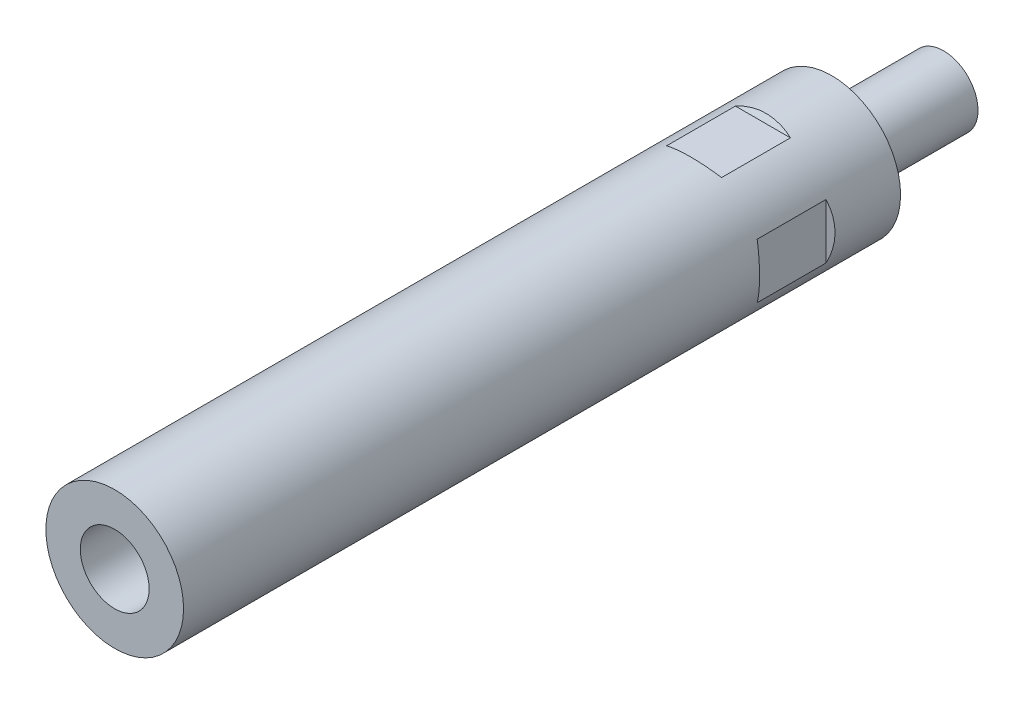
ISO-10303-21;
HEADER;
FILE_DESCRIPTION(('STEP AP214'),'2;1');
FILE_NAME('part.step','',(''),(''),'','','');
FILE_SCHEMA(('AUTOMOTIVE_DESIGN { 1 0 10303 214 1 1 1 1 }'));
ENDSEC;
DATA;
#1=APPLICATION_CONTEXT('core data for automotive mechanical design processes');
#2=APPLICATION_PROTOCOL_DEFINITION('international standard','automotive_design',2000,#1);
#3=PRODUCT_CONTEXT('',#1,'mechanical');
#4=PRODUCT('Part','Part','',(#3));
#5=PRODUCT_RELATED_PRODUCT_CATEGORY('part','',(#4));
#6=PRODUCT_DEFINITION_FORMATION('','',#4);
#7=PRODUCT_DEFINITION_CONTEXT('part definition',#1,'design');
#8=PRODUCT_DEFINITION('design','',#6,#7);
#9=PRODUCT_DEFINITION_SHAPE('','',#8);
#10=(LENGTH_UNIT() NAMED_UNIT(*) SI_UNIT(.MILLI.,.METRE.));
#11=(NAMED_UNIT(*) PLANE_ANGLE_UNIT() SI_UNIT($,.RADIAN.));
#12=(NAMED_UNIT(*) SI_UNIT($,.STERADIAN.) SOLID_ANGLE_UNIT());
#13=UNCERTAINTY_MEASURE_WITH_UNIT(LENGTH_MEASURE(1.E-05),#10,'distance_accuracy_value','');
#14=(GEOMETRIC_REPRESENTATION_CONTEXT(3) GLOBAL_UNCERTAINTY_ASSIGNED_CONTEXT((#13)) GLOBAL_UNIT_ASSIGNED_CONTEXT((#10,
#11,#12)) REPRESENTATION_CONTEXT('',''));
#15=CARTESIAN_POINT('',(0.,0.,0.));
#16=DIRECTION('',(0.,0.,1.));
#17=DIRECTION('',(1.,0.,0.));
#18=AXIS2_PLACEMENT_3D('',#15,#16,#17);
#19=CARTESIAN_POINT('',(0.,0.,0.5));
#20=DIRECTION('',(0.,0.,1.));
#21=DIRECTION('',(0.,-1.,0.));
#22=AXIS2_PLACEMENT_3D('',#19,#20,#21);
#23=CYLINDRICAL_SURFACE('',#22,6.);
#24=CARTESIAN_POINT('',(0.,0.,-19.5));
#25=DIRECTION('',(0.,0.,1.));
#26=DIRECTION('',(0.,-1.,0.));
#27=AXIS2_PLACEMENT_3D('',#24,#25,#26);
#28=CIRCLE('',#27,6.);
#29=CARTESIAN_POINT('',(0.,-6.,-19.5));
#30=VERTEX_POINT('',#29);
#31=EDGE_CURVE('E22',#30,#30,#28,.F.);
#32=ORIENTED_EDGE('',*,*,#31,.F.);
#33=EDGE_LOOP('',(#32));
#34=FACE_BOUND('',#33,.T.);
#35=CARTESIAN_POINT('',(0.,0.,0.));
#36=DIRECTION('',(0.,0.,1.));
#37=DIRECTION('',(1.,0.,0.));
#38=AXIS2_PLACEMENT_3D('',#35,#36,#37);
#39=CIRCLE('',#38,6.);
#40=CARTESIAN_POINT('',(6.,0.,0.));
#41=VERTEX_POINT('',#40);
#42=EDGE_CURVE('E9',#41,#41,#39,.T.);
#43=ORIENTED_EDGE('',*,*,#42,.F.);
#44=EDGE_LOOP('',(#43));
#45=FACE_BOUND('',#44,.T.);
#46=ADVANCED_FACE('F14',(#34,#45),#23,.T.);
#47=CARTESIAN_POINT('',(0.,0.,-19.5));
#48=DIRECTION('',(0.,0.,1.));
#49=DIRECTION('',(0.,-1.,0.));
#50=AXIS2_PLACEMENT_3D('',#47,#48,#49);
#51=PLANE('',#50);
#52=ORIENTED_EDGE('',*,*,#31,.T.);
#53=EDGE_LOOP('',(#52));
#54=FACE_BOUND('',#53,.T.);
#55=ADVANCED_FACE('F16',(#54),#51,.F.);
#56=CARTESIAN_POINT('',(5.1,0.,95.));
#57=DIRECTION('',(0.,0.,-1.));
#58=DIRECTION('',(-1.,0.,0.));
#59=AXIS2_PLACEMENT_3D('',#56,#57,#58);
#60=PLANE('',#59);
#61=CARTESIAN_POINT('',(0.,0.,95.));
#62=DIRECTION('',(0.,0.,1.));
#63=DIRECTION('',(1.,0.,0.));
#64=AXIS2_PLACEMENT_3D('',#61,#62,#63);
#65=CIRCLE('',#64,6.);
#66=CARTESIAN_POINT('',(6.,0.,95.));
#67=VERTEX_POINT('',#66);
#68=EDGE_CURVE('E251',#67,#67,#65,.T.);
#69=ORIENTED_EDGE('',*,*,#68,.T.);
#70=EDGE_LOOP('',(#69));
#71=FACE_BOUND('',#70,.T.);
#72=ADVANCED_FACE('F125',(#71),#60,.F.);
#73=CARTESIAN_POINT('',(0.,0.,125.));
#74=DIRECTION('',(0.,0.,1.));
#75=DIRECTION('',(1.,0.,0.));
#76=AXIS2_PLACEMENT_3D('',#73,#74,#75);
#77=CYLINDRICAL_SURFACE('',#76,6.);
#78=ORIENTED_EDGE('',*,*,#68,.F.);
#79=EDGE_LOOP('',(#78));
#80=FACE_BOUND('',#79,.T.);
#81=CARTESIAN_POINT('',(0.,0.,125.));
#82=DIRECTION('',(0.,0.,1.));
#83=DIRECTION('',(1.,0.,0.));
#84=AXIS2_PLACEMENT_3D('',#81,#82,#83);
#85=CIRCLE('',#84,6.);
#86=CARTESIAN_POINT('',(6.,0.,125.));
#87=VERTEX_POINT('',#86);
#88=EDGE_CURVE('E96',#87,#87,#85,.T.);
#89=ORIENTED_EDGE('',*,*,#88,.T.);
#90=EDGE_LOOP('',(#89));
#91=FACE_BOUND('',#90,.T.);
#92=ADVANCED_FACE('F127',(#80,#91),#77,.F.);
#93=CARTESIAN_POINT('',(0.,0.,125.));
#94=DIRECTION('',(0.,0.,1.));
#95=DIRECTION('',(1.,0.,0.));
#96=AXIS2_PLACEMENT_3D('',#93,#94,#95);
#97=PLANE('',#96);
#98=ORIENTED_EDGE('',*,*,#88,.F.);
#99=EDGE_LOOP('',(#98));
#100=FACE_BOUND('',#99,.T.);
#101=CARTESIAN_POINT('',(0.,0.,125.));
#102=DIRECTION('',(0.,0.,1.));
#103=DIRECTION('',(1.,0.,0.));
#104=AXIS2_PLACEMENT_3D('',#101,#102,#103);
#105=CIRCLE('',#104,12.);
#106=CARTESIAN_POINT('',(12.,0.,125.));
#107=VERTEX_POINT('',#106);
#108=EDGE_CURVE('E239',#107,#107,#105,.T.);
#109=ORIENTED_EDGE('',*,*,#108,.T.);
#110=EDGE_LOOP('',(#109));
#111=FACE_BOUND('',#110,.T.);
#112=ADVANCED_FACE('F134',(#100,#111),#97,.T.);
#113=CARTESIAN_POINT('',(11.,-12.,24.));
#114=DIRECTION('',(-0.5,0.,0.866025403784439));
#115=DIRECTION('',(0.866025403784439,0.,0.5));
#116=AXIS2_PLACEMENT_3D('',#113,#114,#115);
#117=PLANE('',#116);
#118=DIRECTION('',(0.,1.,0.));
#119=VECTOR('',#118,1.);
#120=CARTESIAN_POINT('',(11.,-12.,24.));
#121=LINE('',#120,#119);
#122=CARTESIAN_POINT('',(11.,-4.79583152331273,24.));
#123=VERTEX_POINT('',#122);
#124=CARTESIAN_POINT('',(11.,4.79583152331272,24.));
#125=VERTEX_POINT('',#124);
#126=EDGE_CURVE('E183',#123,#125,#121,.T.);
#127=ORIENTED_EDGE('',*,*,#126,.T.);
#128=CARTESIAN_POINT('',(0.,0.,17.6491470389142));
#129=DIRECTION('',(-0.5,0.,0.866025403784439));
#130=DIRECTION('',(-0.866025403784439,0.,-0.5));
#131=AXIS2_PLACEMENT_3D('',#128,#129,#130);
#132=ELLIPSE('',#131,13.856406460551,12.);
#133=EDGE_CURVE('E35',#123,#125,#132,.T.);
#134=ORIENTED_EDGE('',*,*,#133,.F.);
#135=EDGE_LOOP('',(#127,#134));
#136=FACE_BOUND('',#135,.T.);
#137=ADVANCED_FACE('F175',(#136),#117,.F.);
#138=CARTESIAN_POINT('',(11.,-12.,24.));
#139=DIRECTION('',(-1.,0.,0.));
#140=DIRECTION('',(0.,0.,1.));
#141=AXIS2_PLACEMENT_3D('',#138,#139,#140);
#142=PLANE('',#141);
#143=ORIENTED_EDGE('',*,*,#126,.F.);
#144=DIRECTION('',(0.,0.,-1.));
#145=VECTOR('',#144,1.);
#146=CARTESIAN_POINT('',(11.,-4.79583152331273,125.));
#147=LINE('',#146,#145);
#148=CARTESIAN_POINT('',(11.,-4.79583152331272,12.));
#149=VERTEX_POINT('',#148);
#150=EDGE_CURVE('E191',#149,#123,#147,.F.);
#151=ORIENTED_EDGE('',*,*,#150,.F.);
#152=DIRECTION('',(0.,1.,0.));
#153=VECTOR('',#152,1.);
#154=CARTESIAN_POINT('',(11.,-12.,12.));
#155=LINE('',#154,#153);
#156=CARTESIAN_POINT('',(11.,4.7958315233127,12.));
#157=VERTEX_POINT('',#156);
#158=EDGE_CURVE('E187',#149,#157,#155,.T.);
#159=ORIENTED_EDGE('',*,*,#158,.T.);
#160=DIRECTION('',(0.,0.,-1.));
#161=VECTOR('',#160,1.);
#162=CARTESIAN_POINT('',(11.,4.79583152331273,125.));
#163=LINE('',#162,#161);
#164=EDGE_CURVE('E29',#125,#157,#163,.T.);
#165=ORIENTED_EDGE('',*,*,#164,.F.);
#166=EDGE_LOOP('',(#143,#151,#159,#165));
#167=FACE_BOUND('',#166,.T.);
#168=ADVANCED_FACE('F172',(#167),#142,.F.);
#169=CARTESIAN_POINT('',(11.,-12.,12.));
#170=DIRECTION('',(-0.5,0.,-0.866025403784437));
#171=DIRECTION('',(-0.866025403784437,0.,0.5));
#172=AXIS2_PLACEMENT_3D('',#169,#170,#171);
#173=PLANE('',#172);
#174=CARTESIAN_POINT('',(0.,0.,18.350852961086));
#175=DIRECTION('',(-0.5,0.,-0.866025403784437));
#176=DIRECTION('',(0.866025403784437,0.,-0.5));
#177=AXIS2_PLACEMENT_3D('',#174,#175,#176);
#178=ELLIPSE('',#177,13.856406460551,12.);
#179=EDGE_CURVE('E195',#157,#149,#178,.T.);
#180=ORIENTED_EDGE('',*,*,#179,.F.);
#181=ORIENTED_EDGE('',*,*,#158,.F.);
#182=EDGE_LOOP('',(#180,#181));
#183=FACE_BOUND('',#182,.T.);
#184=ADVANCED_FACE('F167',(#183),#173,.F.);
#185=CARTESIAN_POINT('',(-11.,-12.,12.));
#186=DIRECTION('',(0.5,0.,-0.866025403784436));
#187=DIRECTION('',(-0.866025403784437,0.,-0.5));
#188=AXIS2_PLACEMENT_3D('',#185,#186,#187);
#189=PLANE('',#188);
#190=CARTESIAN_POINT('',(0.,0.,18.350852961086));
#191=DIRECTION('',(0.5,0.,-0.866025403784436));
#192=DIRECTION('',(-0.866025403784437,0.,-0.5));
#193=AXIS2_PLACEMENT_3D('',#190,#191,#192);
#194=ELLIPSE('',#193,13.8564064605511,12.);
#195=CARTESIAN_POINT('',(-11.,-4.79583152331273,12.));
#196=VERTEX_POINT('',#195);
#197=CARTESIAN_POINT('',(-11.,4.79583152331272,12.));
#198=VERTEX_POINT('',#197);
#199=EDGE_CURVE('E193',#196,#198,#194,.T.);
#200=ORIENTED_EDGE('',*,*,#199,.F.);
#201=DIRECTION('',(0.,1.,0.));
#202=VECTOR('',#201,1.);
#203=CARTESIAN_POINT('',(-11.,-12.,12.));
#204=LINE('',#203,#202);
#205=EDGE_CURVE('E227',#196,#198,#204,.T.);
#206=ORIENTED_EDGE('',*,*,#205,.T.);
#207=EDGE_LOOP('',(#200,#206));
#208=FACE_BOUND('',#207,.T.);
#209=ADVANCED_FACE('F163',(#208),#189,.F.);
#210=CARTESIAN_POINT('',(-11.,-12.,24.));
#211=DIRECTION('',(0.5,0.,0.866025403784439));
#212=DIRECTION('',(0.866025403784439,0.,-0.5));
#213=AXIS2_PLACEMENT_3D('',#210,#211,#212);
#214=PLANE('',#213);
#215=DIRECTION('',(0.,1.,0.));
#216=VECTOR('',#215,1.);
#217=CARTESIAN_POINT('',(-11.,-12.,24.));
#218=LINE('',#217,#216);
#219=CARTESIAN_POINT('',(-11.,-4.79583152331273,24.));
#220=VERTEX_POINT('',#219);
#221=CARTESIAN_POINT('',(-11.,4.79583152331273,24.));
#222=VERTEX_POINT('',#221);
#223=EDGE_CURVE('E231',#220,#222,#218,.T.);
#224=ORIENTED_EDGE('',*,*,#223,.F.);
#225=CARTESIAN_POINT('',(0.,0.,17.6491470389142));
#226=DIRECTION('',(0.5,0.,0.866025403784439));
#227=DIRECTION('',(0.866025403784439,0.,-0.5));
#228=AXIS2_PLACEMENT_3D('',#225,#226,#227);
#229=ELLIPSE('',#228,13.856406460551,12.);
#230=EDGE_CURVE('E206',#222,#220,#229,.T.);
#231=ORIENTED_EDGE('',*,*,#230,.F.);
#232=EDGE_LOOP('',(#224,#231));
#233=FACE_BOUND('',#232,.T.);
#234=ADVANCED_FACE('F160',(#233),#214,.F.);
#235=CARTESIAN_POINT('',(-11.,-12.,24.));
#236=DIRECTION('',(1.,0.,0.));
#237=DIRECTION('',(0.,0.,-1.));
#238=AXIS2_PLACEMENT_3D('',#235,#236,#237);
#239=PLANE('',#238);
#240=ORIENTED_EDGE('',*,*,#223,.T.);
#241=DIRECTION('',(0.,0.,-1.));
#242=VECTOR('',#241,1.);
#243=CARTESIAN_POINT('',(-11.,4.79583152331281,125.));
#244=LINE('',#243,#242);
#245=EDGE_CURVE('E200',#198,#222,#244,.F.);
#246=ORIENTED_EDGE('',*,*,#245,.F.);
#247=ORIENTED_EDGE('',*,*,#205,.F.);
#248=DIRECTION('',(0.,0.,-1.));
#249=VECTOR('',#248,1.);
#250=CARTESIAN_POINT('',(-11.,-4.79583152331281,125.));
#251=LINE('',#250,#249);
#252=EDGE_CURVE('E203',#220,#196,#251,.T.);
#253=ORIENTED_EDGE('',*,*,#252,.F.);
#254=EDGE_LOOP('',(#240,#246,#247,#253));
#255=FACE_BOUND('',#254,.T.);
#256=ADVANCED_FACE('F158',(#255),#239,.F.);
#257=CARTESIAN_POINT('',(12.,11.,24.));
#258=DIRECTION('',(0.,-0.5,0.866025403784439));
#259=DIRECTION('',(0.,-0.866025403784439,-0.5));
#260=AXIS2_PLACEMENT_3D('',#257,#258,#259);
#261=PLANE('',#260);
#262=DIRECTION('',(-1.,0.,0.));
#263=VECTOR('',#262,1.);
#264=CARTESIAN_POINT('',(12.,11.,24.));
#265=LINE('',#264,#263);
#266=CARTESIAN_POINT('',(4.79583152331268,11.,24.));
#267=VERTEX_POINT('',#266);
#268=CARTESIAN_POINT('',(-4.79583152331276,11.,24.));
#269=VERTEX_POINT('',#268);
#270=EDGE_CURVE('E225',#267,#269,#265,.T.);
#271=ORIENTED_EDGE('',*,*,#270,.T.);
#272=CARTESIAN_POINT('',(0.,0.,17.6491470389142));
#273=DIRECTION('',(0.,-0.5,0.866025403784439));
#274=DIRECTION('',(0.,-0.866025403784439,-0.5));
#275=AXIS2_PLACEMENT_3D('',#272,#273,#274);
#276=ELLIPSE('',#275,13.856406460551,12.);
#277=EDGE_CURVE('E214',#267,#269,#276,.T.);
#278=ORIENTED_EDGE('',*,*,#277,.F.);
#279=EDGE_LOOP('',(#271,#278));
#280=FACE_BOUND('',#279,.T.);
#281=ADVANCED_FACE('F151',(#280),#261,.F.);
#282=CARTESIAN_POINT('',(12.,11.,24.));
#283=DIRECTION('',(0.,-1.,0.));
#284=DIRECTION('',(1.,0.,0.));
#285=AXIS2_PLACEMENT_3D('',#282,#283,#284);
#286=PLANE('',#285);
#287=ORIENTED_EDGE('',*,*,#270,.F.);
#288=DIRECTION('',(0.,0.,-1.));
#289=VECTOR('',#288,1.);
#290=CARTESIAN_POINT('',(4.79583152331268,11.,125.));
#291=LINE('',#290,#289);
#292=CARTESIAN_POINT('',(4.79583152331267,11.,12.));
#293=VERTEX_POINT('',#292);
#294=EDGE_CURVE('E88',#293,#267,#291,.F.);
#295=ORIENTED_EDGE('',*,*,#294,.F.);
#296=DIRECTION('',(-1.,0.,0.));
#297=VECTOR('',#296,1.);
#298=CARTESIAN_POINT('',(12.,11.,12.));
#299=LINE('',#298,#297);
#300=CARTESIAN_POINT('',(-4.79583152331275,11.,12.));
#301=VERTEX_POINT('',#300);
#302=EDGE_CURVE('E223',#293,#301,#299,.T.);
#303=ORIENTED_EDGE('',*,*,#302,.T.);
#304=DIRECTION('',(0.,0.,-1.));
#305=VECTOR('',#304,1.);
#306=CARTESIAN_POINT('',(-4.79583152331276,11.,125.));
#307=LINE('',#306,#305);
#308=EDGE_CURVE('E211',#269,#301,#307,.T.);
#309=ORIENTED_EDGE('',*,*,#308,.F.);
#310=EDGE_LOOP('',(#287,#295,#303,#309));
#311=FACE_BOUND('',#310,.T.);
#312=ADVANCED_FACE('F148',(#311),#286,.F.);
#313=CARTESIAN_POINT('',(12.,11.,12.));
#314=DIRECTION('',(0.,-0.5,-0.866025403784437));
#315=DIRECTION('',(0.,0.866025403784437,-0.5));
#316=AXIS2_PLACEMENT_3D('',#313,#314,#315);
#317=PLANE('',#316);
#318=CARTESIAN_POINT('',(0.,0.,18.350852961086));
#319=DIRECTION('',(0.,-0.5,-0.866025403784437));
#320=DIRECTION('',(0.,0.866025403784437,-0.5));
#321=AXIS2_PLACEMENT_3D('',#318,#319,#320);
#322=ELLIPSE('',#321,13.856406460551,12.);
#323=EDGE_CURVE('E209',#301,#293,#322,.T.);
#324=ORIENTED_EDGE('',*,*,#323,.F.);
#325=ORIENTED_EDGE('',*,*,#302,.F.);
#326=EDGE_LOOP('',(#324,#325));
#327=FACE_BOUND('',#326,.T.);
#328=ADVANCED_FACE('F145',(#327),#317,.F.);
#329=CARTESIAN_POINT('',(12.,-11.,12.));
#330=DIRECTION('',(0.,0.5,-0.866025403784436));
#331=DIRECTION('',(0.,0.866025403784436,0.5));
#332=AXIS2_PLACEMENT_3D('',#329,#330,#331);
#333=PLANE('',#332);
#334=CARTESIAN_POINT('',(0.,0.,18.350852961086));
#335=DIRECTION('',(0.,0.5,-0.866025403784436));
#336=DIRECTION('',(0.,-0.866025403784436,-0.5));
#337=AXIS2_PLACEMENT_3D('',#334,#335,#336);
#338=ELLIPSE('',#337,13.8564064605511,12.);
#339=CARTESIAN_POINT('',(4.79583152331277,-11.,12.));
#340=VERTEX_POINT('',#339);
#341=CARTESIAN_POINT('',(-4.79583152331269,-11.,12.));
#342=VERTEX_POINT('',#341);
#343=EDGE_CURVE('E79',#340,#342,#338,.T.);
#344=ORIENTED_EDGE('',*,*,#343,.F.);
#345=DIRECTION('',(-1.,0.,0.));
#346=VECTOR('',#345,1.);
#347=CARTESIAN_POINT('',(12.,-11.,12.));
#348=LINE('',#347,#346);
#349=EDGE_CURVE('E82',#340,#342,#348,.T.);
#350=ORIENTED_EDGE('',*,*,#349,.T.);
#351=EDGE_LOOP('',(#344,#350));
#352=FACE_BOUND('',#351,.T.);
#353=ADVANCED_FACE('F81',(#352),#333,.F.);
#354=CARTESIAN_POINT('',(12.,-11.,24.));
#355=DIRECTION('',(0.,0.5,0.866025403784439));
#356=DIRECTION('',(0.,-0.866025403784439,0.5));
#357=AXIS2_PLACEMENT_3D('',#354,#355,#356);
#358=PLANE('',#357);
#359=DIRECTION('',(-1.,0.,0.));
#360=VECTOR('',#359,1.);
#361=CARTESIAN_POINT('',(12.,-11.,24.));
#362=LINE('',#361,#360);
#363=CARTESIAN_POINT('',(4.79583152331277,-11.,24.));
#364=VERTEX_POINT('',#363);
#365=CARTESIAN_POINT('',(-4.79583152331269,-11.,24.));
#366=VERTEX_POINT('',#365);
#367=EDGE_CURVE('E95',#364,#366,#362,.T.);
#368=ORIENTED_EDGE('',*,*,#367,.F.);
#369=CARTESIAN_POINT('',(0.,0.,17.6491470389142));
#370=DIRECTION('',(0.,0.5,0.866025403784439));
#371=DIRECTION('',(0.,0.866025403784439,-0.5));
#372=AXIS2_PLACEMENT_3D('',#369,#370,#371);
#373=ELLIPSE('',#372,13.856406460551,12.);
#374=EDGE_CURVE('E101',#366,#364,#373,.T.);
#375=ORIENTED_EDGE('',*,*,#374,.F.);
#376=EDGE_LOOP('',(#368,#375));
#377=FACE_BOUND('',#376,.T.);
#378=ADVANCED_FACE('F139',(#377),#358,.F.);
#379=CARTESIAN_POINT('',(12.,-11.,24.));
#380=DIRECTION('',(0.,1.,0.));
#381=DIRECTION('',(-1.,0.,0.));
#382=AXIS2_PLACEMENT_3D('',#379,#380,#381);
#383=PLANE('',#382);
#384=ORIENTED_EDGE('',*,*,#367,.T.);
#385=DIRECTION('',(0.,0.,-1.));
#386=VECTOR('',#385,1.);
#387=CARTESIAN_POINT('',(-4.79583152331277,-11.,125.));
#388=LINE('',#387,#386);
#389=EDGE_CURVE('E87',#342,#366,#388,.F.);
#390=ORIENTED_EDGE('',*,*,#389,.F.);
#391=ORIENTED_EDGE('',*,*,#349,.F.);
#392=DIRECTION('',(0.,0.,-1.));
#393=VECTOR('',#392,1.);
#394=CARTESIAN_POINT('',(4.79583152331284,-11.,125.));
#395=LINE('',#394,#393);
#396=EDGE_CURVE('E93',#364,#340,#395,.T.);
#397=ORIENTED_EDGE('',*,*,#396,.F.);
#398=EDGE_LOOP('',(#384,#390,#391,#397));
#399=FACE_BOUND('',#398,.T.);
#400=ADVANCED_FACE('F92',(#399),#383,.F.);
#401=CARTESIAN_POINT('',(0.,0.,125.));
#402=DIRECTION('',(0.,0.,-1.));
#403=DIRECTION('',(-1.,0.,0.));
#404=AXIS2_PLACEMENT_3D('',#401,#402,#403);
#405=CYLINDRICAL_SURFACE('',#404,12.);
#406=ORIENTED_EDGE('',*,*,#389,.T.);
#407=ORIENTED_EDGE('',*,*,#374,.T.);
#408=ORIENTED_EDGE('',*,*,#396,.T.);
#409=ORIENTED_EDGE('',*,*,#343,.T.);
#410=EDGE_LOOP('',(#406,#407,#408,#409));
#411=FACE_BOUND('',#410,.T.);
#412=ORIENTED_EDGE('',*,*,#323,.T.);
#413=ORIENTED_EDGE('',*,*,#294,.T.);
#414=ORIENTED_EDGE('',*,*,#277,.T.);
#415=ORIENTED_EDGE('',*,*,#308,.T.);
#416=EDGE_LOOP('',(#412,#413,#414,#415));
#417=FACE_BOUND('',#416,.T.);
#418=ORIENTED_EDGE('',*,*,#245,.T.);
#419=ORIENTED_EDGE('',*,*,#230,.T.);
#420=ORIENTED_EDGE('',*,*,#252,.T.);
#421=ORIENTED_EDGE('',*,*,#199,.T.);
#422=EDGE_LOOP('',(#418,#419,#420,#421));
#423=FACE_BOUND('',#422,.T.);
#424=ORIENTED_EDGE('',*,*,#179,.T.);
#425=ORIENTED_EDGE('',*,*,#150,.T.);
#426=ORIENTED_EDGE('',*,*,#133,.T.);
#427=ORIENTED_EDGE('',*,*,#164,.T.);
#428=EDGE_LOOP('',(#424,#425,#426,#427));
#429=FACE_BOUND('',#428,.T.);
#430=ORIENTED_EDGE('',*,*,#108,.F.);
#431=EDGE_LOOP('',(#430));
#432=FACE_BOUND('',#431,.T.);
#433=CARTESIAN_POINT('',(0.,0.,0.));
#434=DIRECTION('',(0.,0.,1.));
#435=DIRECTION('',(1.,0.,0.));
#436=AXIS2_PLACEMENT_3D('',#433,#434,#435);
#437=CIRCLE('',#436,12.);
#438=CARTESIAN_POINT('',(12.,0.,0.));
#439=VERTEX_POINT('',#438);
#440=EDGE_CURVE('E186',#439,#439,#437,.T.);
#441=ORIENTED_EDGE('',*,*,#440,.T.);
#442=EDGE_LOOP('',(#441));
#443=FACE_BOUND('',#442,.T.);
#444=ADVANCED_FACE('F99',(#411,#417,#423,#429,#432,#443),#405,.T.);
#445=CARTESIAN_POINT('',(0.,0.,0.));
#446=DIRECTION('',(0.,0.,1.));
#447=DIRECTION('',(1.,0.,0.));
#448=AXIS2_PLACEMENT_3D('',#445,#446,#447);
#449=PLANE('',#448);
#450=ORIENTED_EDGE('',*,*,#440,.F.);
#451=EDGE_LOOP('',(#450));
#452=FACE_BOUND('',#451,.T.);
#453=ORIENTED_EDGE('',*,*,#42,.T.);
#454=EDGE_LOOP('',(#453));
#455=FACE_BOUND('',#454,.T.);
#456=ADVANCED_FACE('F111',(#452,#455),#449,.F.);
#457=CLOSED_SHELL('',(#46,#55,#72,#92,#112,#137,#168,#184,#209,#234,#256,#281,#312,#328,#353,
#378,#400,#444,#456));
#458=MANIFOLD_SOLID_BREP('B1',#457);
#459=ADVANCED_BREP_SHAPE_REPRESENTATION('',(#18,#458),#14);
#460=SHAPE_DEFINITION_REPRESENTATION(#9,#459);
ENDSEC;
END-ISO-10303-21;
